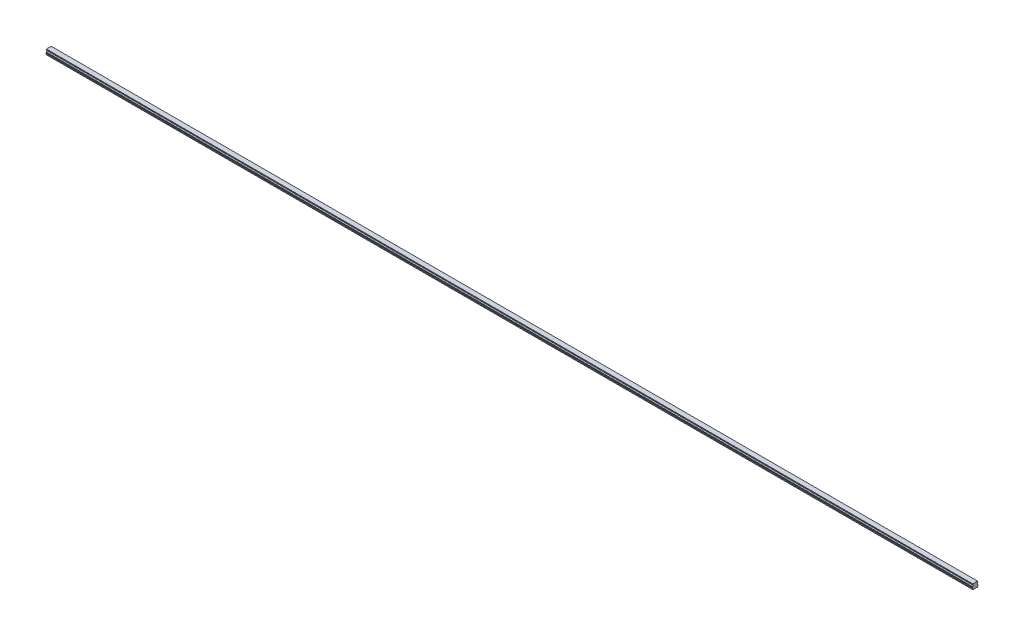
from build123d import *

# Parameters (mm, degrees)
BOSS_EXTRUDE1_DEPTH        = 2520
SKETCH3_R                  = 2.5
SKETCH3_R_2                = 2.1
CUT_EXTRUDE3_DEPTH         = 7
SKETCH3_2_R                = 2.1
CUT_EXTRUDE4_DEPTH         = 9.5
CHAMFER1_SIZE              = 0.4
LPATTERN2_COUNT            = 42
LPATTERN2_PITCH            = 60
CHAMFER1_OF_LPATTERN2_SIZE = 0.4


with BuildPart() as part:
    # Sketch1 → Boss-Extrude1 (new body)
    with BuildSketch(Plane(origin=(0, 0, 0), x_dir=(0, 0, -1), z_dir=(1, 0, 0))):
        with BuildLine():
            Line((6.59, 14), (-6.59, 14))
            Line((-6.59, 14), (-6.59, 13.15))
            Line((-6.59, 13.15), (-6.96, 12.356532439))
            Line((-6.96, 12.356532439), (-6.96, 11.435174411))
            ThreePointArc((-6.96, 11.435174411), (-5.25, 9.5), (-6.96, 7.564825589))
            Line((-6.96, 7.564825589), (-6.96, 6.643467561))
            Line((-6.96, 6.643467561), (-6.59, 5.85))
            Line((-6.59, 5.85), (-7.032116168, 4.2))
            Line((-7.032116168, 4.2), (-7.5, 3.929867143))
            Line((-7.5, 3.929867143), (-7.5, 1.4))
            Line((-7.5, 1.4), (-6.1, 0))
            Line((-6.1, 0), (-3.65, 0))
            Line((-3.65, 0), (-3.25, 0.4))
            Line((-3.25, 0.4), (3.25, 0.4))
            Line((3.25, 0.4), (3.65, 0))
            Line((3.65, 0), (6.1, 0))
            Line((6.1, 0), (7.5, 1.4))
            Line((7.5, 1.4), (7.5, 3.929867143))
            Line((7.5, 3.929867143), (7.032116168, 4.2))
            Line((7.032116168, 4.2), (6.59, 5.85))
            Line((6.59, 5.85), (6.96, 6.643467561))
            Line((6.96, 6.643467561), (6.96, 7.564825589))
            ThreePointArc((6.96, 7.564825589), (5.25, 9.5), (6.96, 11.435174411))
            Line((6.96, 11.435174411), (6.96, 12.356532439))
            Line((6.96, 12.356532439), (6.59, 13.15))
            Line((6.59, 13.15), (6.59, 14))
        make_face()
    extrude(amount=BOSS_EXTRUDE1_DEPTH)

    # Sketch3 → Cut-Extrude3 (cut)
    with BuildSketch(Plane.XZ):
        with Locations(Location((30, 0, 0), (0, 0, 270))):
            Circle(SKETCH3_R)
        with Locations(Location((30, 0, 0), (0, 0, 270))):
            Circle(SKETCH3_R_2, mode=Mode.SUBTRACT)
    cut_extrude3 = extrude(amount=-CUT_EXTRUDE3_DEPTH, mode=Mode.SUBTRACT)

    # Sketch3_2 → Cut-Extrude4 (cut)
    with BuildSketch(Plane.XZ):
        with Locations(Location((30, 0, 0), (0, 0, 270))):
            Circle(SKETCH3_2_R)
    cut_extrude4 = extrude(amount=-CUT_EXTRUDE4_DEPTH, mode=Mode.SUBTRACT)

    # Cut-Extrude5 cone 1 section (on through the dimple's axis) → Cut-Extrude5 (revolve, cut)
    with BuildSketch(Plane(origin=(30, 9.5, 0), x_dir=(0, 0, -1), z_dir=(1, 0, 0))):
        Polygon((0, 0), (2.1, 0), (0, 1.212435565), align=None)
    revolve(axis=Axis((30, 9.5, 0), (0, 1, 0)), mode=Mode.SUBTRACT)

    # Chamfer1
    chamfer1_edges = [part.edges().sort_by_distance(p)[0] for p in [
        (30, 0.4, 2.5),
    ]]
    chamfer(chamfer1_edges, length=CHAMFER1_SIZE)

    # LPattern2: Cut-Extrude3, Cut-Extrude4 ×42
    with Locations(*[(i * LPATTERN2_PITCH, 0, 0) for i in range(1, LPATTERN2_COUNT)]):
        add(cut_extrude3, mode=Mode.SUBTRACT)
        add(cut_extrude4, mode=Mode.SUBTRACT)

    # Chamfer1 of LPattern2
    chamfer1_of_lpattern2_edges = [part.edges().sort_by_distance(p)[0] for p in [
        (90, 0.4, 2.5),
        (150, 0.4, 2.5),
        (210, 0.4, 2.5),
        (270, 0.4, 2.5),
        (330, 0.4, 2.5),
        (390, 0.4, 2.5),
        (450, 0.4, 2.5),
        (510, 0.4, 2.5),
        (570, 0.4, 2.5),
        (630, 0.4, 2.5),
        (690, 0.4, 2.5),
        (750, 0.4, 2.5),
        (810, 0.4, 2.5),
        (870, 0.4, 2.5),
        (930, 0.4, 2.5),
        (990, 0.4, 2.5),
        (1050, 0.4, 2.5),
        (1110, 0.4, 2.5),
        (1170, 0.4, 2.5),
        (1230, 0.4, 2.5),
        (1290, 0.4, 2.5),
        (1350, 0.4, 2.5),
        (1410, 0.4, 2.5),
        (1470, 0.4, 2.5),
        (1530, 0.4, 2.5),
        (1590, 0.4, 2.5),
        (1650, 0.4, 2.5),
        (1710, 0.4, 2.5),
        (1770, 0.4, 2.5),
        (1830, 0.4, 2.5),
        (1890, 0.4, 2.5),
        (1950, 0.4, 2.5),
        (2010, 0.4, 2.5),
        (2070, 0.4, 2.5),
        (2130, 0.4, 2.5),
        (2190, 0.4, 2.5),
        (2250, 0.4, 2.5),
        (2310, 0.4, 2.5),
        (2370, 0.4, 2.5),
        (2430, 0.4, 2.5),
        (2490, 0.4, 2.5),
    ]]
    chamfer(chamfer1_of_lpattern2_edges, length=CHAMFER1_OF_LPATTERN2_SIZE)


solid = part.part
